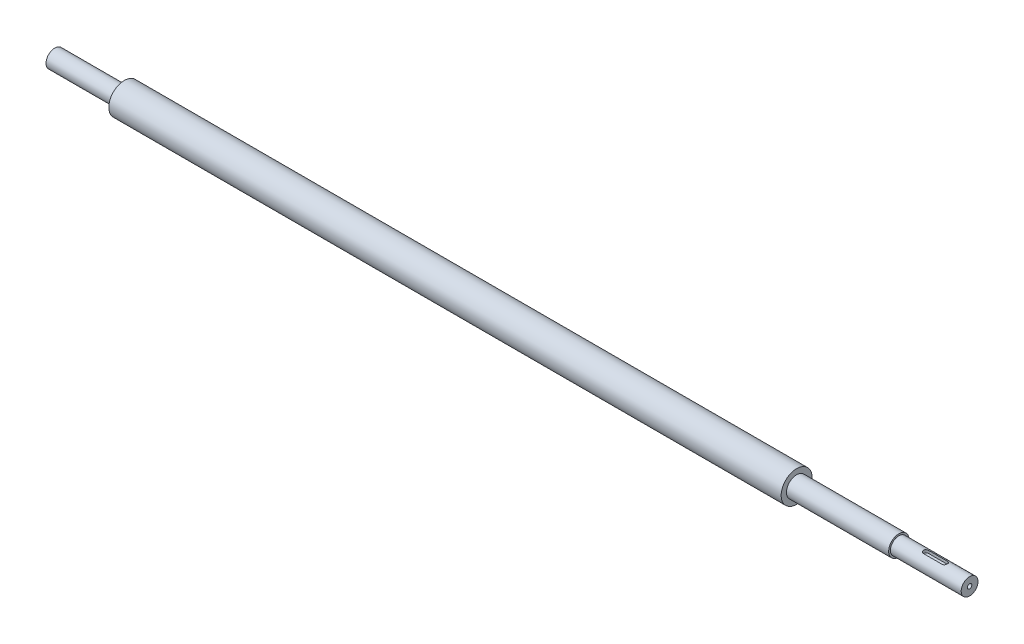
from build123d import *

# Parameters (mm, degrees)
TROU_TARAUD_M6X1_01_D     = 5
TROU_TARAUD_M6X1_01_DEPTH = 18
TROU_TARAUD_M6X1_01_TIP   = 1.502151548
ENL_V_MAT_EXTRU_2_DEPTH   = 3.5


with BuildPart() as part:
    # Esquisse1 → R_volution1 (revolve)
    with BuildSketch(Plane.XY):
        Polygon((-517, 0), (-517, 10), (-438.5, 10), (-438.5, 17.5), (321.5, 17.5), (321.5, 11.5), (437, 11.5), (437, 9.5), (517, 9.5), (517, 0), align=None)
    revolve(axis=Axis((-517, 0, 0), (-1, 0, 0)))

    # Trou taraud_ M6x1.01
    with Locations(Plane(origin=(517, 0, 0), x_dir=(0, 0, -1), z_dir=(1, 0, 0))):
        with Locations((0, 0)):
            Hole(TROU_TARAUD_M6X1_01_D / 2, depth=TROU_TARAUD_M6X1_01_DEPTH)
            with Locations((0, 0, -(TROU_TARAUD_M6X1_01_DEPTH + TROU_TARAUD_M6X1_01_TIP / 2))):  # 118° drill point
                Cone(0, TROU_TARAUD_M6X1_01_D / 2, TROU_TARAUD_M6X1_01_TIP, mode=Mode.SUBTRACT)

    # Esquisse11 → Enl_v. mat.-Extru.2 (cut)
    with BuildSketch(Plane(origin=(517, 9.5, 0), x_dir=(0, 0, 1), z_dir=(0, 1, 0))):
        with BuildLine():
            Line((-3, -28), (-3, -49))
            ThreePointArc((-3, -49), (0, -52), (3, -49))
            Line((3, -49), (3, -28))
            ThreePointArc((3, -28), (0, -25), (-3, -28))
        make_face()
    extrude(amount=-ENL_V_MAT_EXTRU_2_DEPTH, mode=Mode.SUBTRACT)


solid = part.part
